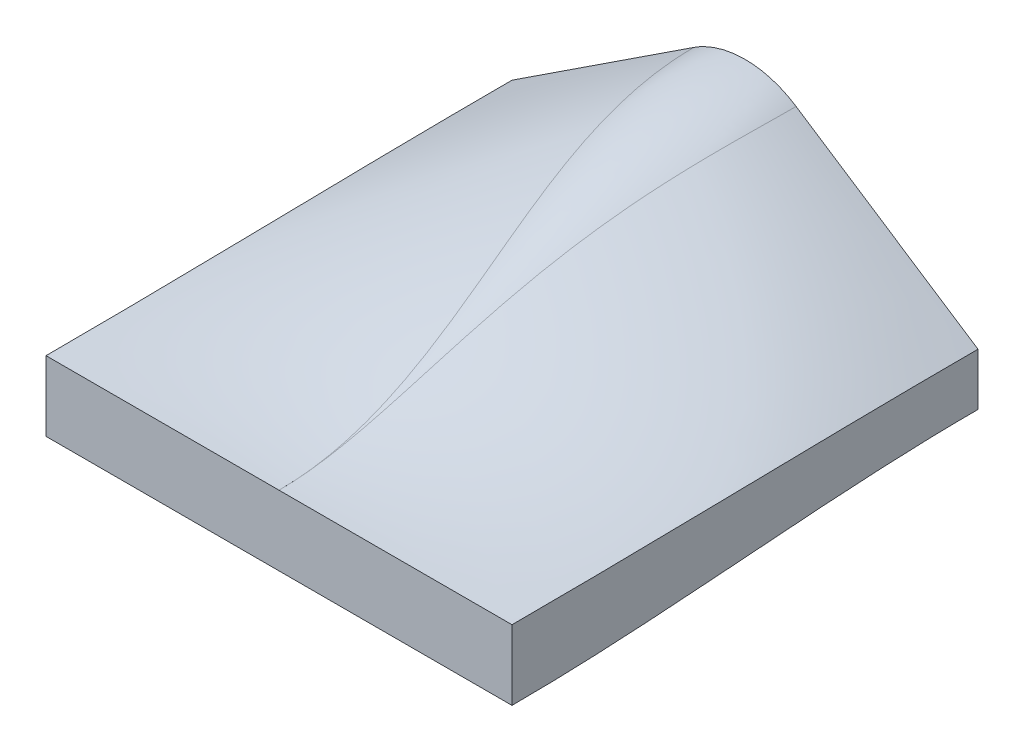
ISO-10303-21;
HEADER;
FILE_DESCRIPTION(('STEP AP214'),'2;1');
FILE_NAME('part.step','',(''),(''),'','','');
FILE_SCHEMA(('AUTOMOTIVE_DESIGN { 1 0 10303 214 1 1 1 1 }'));
ENDSEC;
DATA;
#1=APPLICATION_CONTEXT('core data for automotive mechanical design processes');
#2=APPLICATION_PROTOCOL_DEFINITION('international standard','automotive_design',2000,#1);
#3=PRODUCT_CONTEXT('',#1,'mechanical');
#4=PRODUCT('Part','Part','',(#3));
#5=PRODUCT_RELATED_PRODUCT_CATEGORY('part','',(#4));
#6=PRODUCT_DEFINITION_FORMATION('','',#4);
#7=PRODUCT_DEFINITION_CONTEXT('part definition',#1,'design');
#8=PRODUCT_DEFINITION('design','',#6,#7);
#9=PRODUCT_DEFINITION_SHAPE('','',#8);
#10=(LENGTH_UNIT() NAMED_UNIT(*) SI_UNIT(.MILLI.,.METRE.));
#11=(NAMED_UNIT(*) PLANE_ANGLE_UNIT() SI_UNIT($,.RADIAN.));
#12=(NAMED_UNIT(*) SI_UNIT($,.STERADIAN.) SOLID_ANGLE_UNIT());
#13=UNCERTAINTY_MEASURE_WITH_UNIT(LENGTH_MEASURE(1.E-05),#10,'distance_accuracy_value','');
#14=(GEOMETRIC_REPRESENTATION_CONTEXT(3) GLOBAL_UNCERTAINTY_ASSIGNED_CONTEXT((#13)) GLOBAL_UNIT_ASSIGNED_CONTEXT((#10,
#11,#12)) REPRESENTATION_CONTEXT('',''));
#15=CARTESIAN_POINT('',(0.,0.,0.));
#16=DIRECTION('',(0.,0.,1.));
#17=DIRECTION('',(1.,0.,0.));
#18=AXIS2_PLACEMENT_3D('',#15,#16,#17);
#19=CARTESIAN_POINT('',(0.,0.,-50.));
#20=DIRECTION('',(0.,0.,1.));
#21=DIRECTION('',(1.,0.,0.));
#22=AXIS2_PLACEMENT_3D('',#19,#20,#21);
#23=PLANE('',#22);
#24=DIRECTION('',(-0.836143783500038,-0.548510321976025,0.));
#25=VECTOR('',#24,1.);
#26=CARTESIAN_POINT('',(-25.,0.6,-50.));
#27=LINE('',#26,#25);
#28=CARTESIAN_POINT('',(-5.48510331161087,13.4017722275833,-50.));
#29=VERTEX_POINT('',#28);
#30=CARTESIAN_POINT('',(-25.,0.6,-50.));
#31=VERTEX_POINT('',#30);
#32=EDGE_CURVE('E180',#29,#31,#27,.T.);
#33=ORIENTED_EDGE('',*,*,#32,.F.);
#34=CARTESIAN_POINT('',(5.4851034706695,13.401772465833,-50.0000746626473));
#35=CARTESIAN_POINT('',(0.,17.0000004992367,-49.9997549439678));
#36=CARTESIAN_POINT('',(-5.48510347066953,13.4017724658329,-50.0000746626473));
#37=(BOUNDED_CURVE() B_SPLINE_CURVE(2,(#34,#35,#36),.UNSPECIFIED.,.F.,
.F.) B_SPLINE_CURVE_WITH_KNOTS((3,3),(0.,1.),
.UNSPECIFIED.) CURVE() GEOMETRIC_REPRESENTATION_ITEM() RATIONAL_B_SPLINE_CURVE((1.,
0.836143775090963,1.)) REPRESENTATION_ITEM(''));
#38=CARTESIAN_POINT('',(5.48510331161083,13.4017722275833,-50.));
#39=VERTEX_POINT('',#38);
#40=EDGE_CURVE('E108',#29,#39,#37,.F.);
#41=ORIENTED_EDGE('',*,*,#40,.T.);
#42=DIRECTION('',(-0.836143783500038,0.548510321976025,0.));
#43=VECTOR('',#42,1.);
#44=CARTESIAN_POINT('',(0.,17.,-50.));
#45=LINE('',#44,#43);
#46=CARTESIAN_POINT('',(25.,0.6,-50.));
#47=VERTEX_POINT('',#46);
#48=EDGE_CURVE('E320',#47,#39,#45,.T.);
#49=ORIENTED_EDGE('',*,*,#48,.F.);
#50=DIRECTION('',(0.,1.,0.));
#51=VECTOR('',#50,1.);
#52=CARTESIAN_POINT('',(25.,0.6,-50.));
#53=LINE('',#52,#51);
#54=CARTESIAN_POINT('',(25.,-5.,-50.));
#55=VERTEX_POINT('',#54);
#56=EDGE_CURVE('E250',#55,#47,#53,.T.);
#57=ORIENTED_EDGE('',*,*,#56,.F.);
#58=DIRECTION('',(1.,0.,0.));
#59=VECTOR('',#58,1.);
#60=CARTESIAN_POINT('',(-25.,-5.,-50.));
#61=LINE('',#60,#59);
#62=CARTESIAN_POINT('',(-25.,-5.,-50.));
#63=VERTEX_POINT('',#62);
#64=EDGE_CURVE('E184',#63,#55,#61,.T.);
#65=ORIENTED_EDGE('',*,*,#64,.F.);
#66=DIRECTION('',(0.,-1.,0.));
#67=VECTOR('',#66,1.);
#68=CARTESIAN_POINT('',(-25.,0.6,-50.));
#69=LINE('',#68,#67);
#70=EDGE_CURVE('E182',#31,#63,#69,.T.);
#71=ORIENTED_EDGE('',*,*,#70,.F.);
#72=EDGE_LOOP('',(#33,#41,#49,#57,#65,#71));
#73=FACE_BOUND('',#72,.T.);
#74=ADVANCED_FACE('F94',(#73),#23,.F.);
#75=CARTESIAN_POINT('',(0.,0.,0.));
#76=DIRECTION('',(0.,0.,1.));
#77=DIRECTION('',(1.,0.,0.));
#78=AXIS2_PLACEMENT_3D('',#75,#76,#77);
#79=PLANE('',#78);
#80=DIRECTION('',(0.,-1.,0.));
#81=VECTOR('',#80,1.);
#82=CARTESIAN_POINT('',(-25.,0.,0.));
#83=LINE('',#82,#81);
#84=CARTESIAN_POINT('',(-25.,0.,0.));
#85=VERTEX_POINT('',#84);
#86=CARTESIAN_POINT('',(-25.,-7.5,0.));
#87=VERTEX_POINT('',#86);
#88=EDGE_CURVE('E156',#85,#87,#83,.T.);
#89=ORIENTED_EDGE('',*,*,#88,.T.);
#90=DIRECTION('',(1.,0.,0.));
#91=VECTOR('',#90,1.);
#92=CARTESIAN_POINT('',(-25.,-7.5,0.));
#93=LINE('',#92,#91);
#94=CARTESIAN_POINT('',(25.,-7.5,0.));
#95=VERTEX_POINT('',#94);
#96=EDGE_CURVE('E175',#87,#95,#93,.T.);
#97=ORIENTED_EDGE('',*,*,#96,.T.);
#98=DIRECTION('',(0.,1.,0.));
#99=VECTOR('',#98,1.);
#100=CARTESIAN_POINT('',(25.,0.,0.));
#101=LINE('',#100,#99);
#102=CARTESIAN_POINT('',(25.,0.,0.));
#103=VERTEX_POINT('',#102);
#104=EDGE_CURVE('E302',#95,#103,#101,.T.);
#105=ORIENTED_EDGE('',*,*,#104,.T.);
#106=DIRECTION('',(-1.,0.,0.));
#107=VECTOR('',#106,1.);
#108=CARTESIAN_POINT('',(0.,0.,0.));
#109=LINE('',#108,#107);
#110=CARTESIAN_POINT('',(0.,0.,0.));
#111=VERTEX_POINT('',#110);
#112=EDGE_CURVE('E102',#103,#111,#109,.T.);
#113=ORIENTED_EDGE('',*,*,#112,.T.);
#114=DIRECTION('',(-1.,0.,0.));
#115=VECTOR('',#114,1.);
#116=CARTESIAN_POINT('',(-25.,0.,0.));
#117=LINE('',#116,#115);
#118=EDGE_CURVE('E151',#111,#85,#117,.T.);
#119=ORIENTED_EDGE('',*,*,#118,.T.);
#120=EDGE_LOOP('',(#89,#97,#105,#113,#119));
#121=FACE_BOUND('',#120,.T.);
#122=ADVANCED_FACE('F154',(#121),#79,.T.);
#123=CARTESIAN_POINT('',(25.,0.,0.));
#124=DIRECTION('',(1.,0.,0.));
#125=DIRECTION('',(0.,-1.,0.));
#126=AXIS2_PLACEMENT_3D('',#123,#124,#125);
#127=PLANE('',#126);
#128=ORIENTED_EDGE('',*,*,#104,.F.);
#129=CARTESIAN_POINT('',(25.,-7.5,0.));
#130=CARTESIAN_POINT('',(25.,-7.5,-16.6874869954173));
#131=CARTESIAN_POINT('',(25.,-5.,-33.3125130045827));
#132=CARTESIAN_POINT('',(25.,-5.,-50.));
#133=B_SPLINE_CURVE_WITH_KNOTS('',3,(#129,#130,#131,#132),.UNSPECIFIED.,.F.,.F.,(4,4),(0.,1.),.UNSPECIFIED.);
#134=EDGE_CURVE('E186',#95,#55,#133,.T.);
#135=ORIENTED_EDGE('',*,*,#134,.T.);
#136=ORIENTED_EDGE('',*,*,#56,.T.);
#137=CARTESIAN_POINT('',(25.,0.,0.));
#138=CARTESIAN_POINT('',(25.,0.,-16.6678666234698));
#139=CARTESIAN_POINT('',(25.,0.6,-33.3321333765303));
#140=CARTESIAN_POINT('',(25.,0.6,-50.));
#141=B_SPLINE_CURVE_WITH_KNOTS('',3,(#137,#138,#139,#140),.UNSPECIFIED.,.F.,.F.,(4,4),(0.,1.),.UNSPECIFIED.);
#142=EDGE_CURVE('E163',#47,#103,#141,.F.);
#143=ORIENTED_EDGE('',*,*,#142,.T.);
#144=EDGE_LOOP('',(#128,#135,#136,#143));
#145=FACE_BOUND('',#144,.T.);
#146=ADVANCED_FACE('F256',(#145),#127,.T.);
#147=CARTESIAN_POINT('',(25.,-7.5,0.));
#148=CARTESIAN_POINT('',(25.,-7.5,-16.6874869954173));
#149=CARTESIAN_POINT('',(25.,-5.,-33.3125130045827));
#150=CARTESIAN_POINT('',(25.,-5.,-50.));
#151=CARTESIAN_POINT('',(8.33333333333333,-7.5,0.));
#152=CARTESIAN_POINT('',(8.33333333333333,-7.5,-16.6874869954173));
#153=CARTESIAN_POINT('',(8.33333333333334,-5.,-33.3125130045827));
#154=CARTESIAN_POINT('',(8.33333333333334,-5.,-50.));
#155=CARTESIAN_POINT('',(-8.33333333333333,-7.5,0.));
#156=CARTESIAN_POINT('',(-8.33333333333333,-7.5,-16.6874869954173));
#157=CARTESIAN_POINT('',(-8.33333333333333,-5.,-33.3125130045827));
#158=CARTESIAN_POINT('',(-8.33333333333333,-5.,-50.));
#159=CARTESIAN_POINT('',(-25.,-7.5,0.));
#160=CARTESIAN_POINT('',(-25.,-7.5,-16.6874869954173));
#161=CARTESIAN_POINT('',(-25.,-5.,-33.3125130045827));
#162=CARTESIAN_POINT('',(-25.,-5.,-50.));
#163=B_SPLINE_SURFACE_WITH_KNOTS('',3,3,((#147,#148,#149,#150),(#151,#152,#153,#154),(#155,#156,
#157,#158),(#159,#160,#161,#162)),.UNSPECIFIED.,.F.,.F.,.F.,(4,4),(4,4),(0.,1.),(0.,1.),.UNSPECIFIED.);
#164=CARTESIAN_POINT('',(-25.,-7.5,0.));
#165=CARTESIAN_POINT('',(-25.,-7.5,-16.6874869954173));
#166=CARTESIAN_POINT('',(-25.,-5.,-33.3125130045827));
#167=CARTESIAN_POINT('',(-25.,-5.,-50.));
#168=B_SPLINE_CURVE_WITH_KNOTS('',3,(#164,#165,#166,#167),.UNSPECIFIED.,.F.,.F.,(4,4),(0.,1.),.UNSPECIFIED.);
#169=EDGE_CURVE('E174',#87,#63,#168,.T.);
#170=ORIENTED_EDGE('',*,*,#96,.F.);
#171=ORIENTED_EDGE('',*,*,#169,.T.);
#172=ORIENTED_EDGE('',*,*,#64,.T.);
#173=ORIENTED_EDGE('',*,*,#134,.F.);
#174=EDGE_LOOP('',(#170,#171,#172,#173));
#175=FACE_BOUND('',#174,.T.);
#176=ADVANCED_FACE('F221',(#175),#163,.T.);
#177=CARTESIAN_POINT('',(0.,0.,0.));
#178=CARTESIAN_POINT('',(0.,0.,-17.6036612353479));
#179=CARTESIAN_POINT('',(0.,17.,-32.3963387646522));
#180=CARTESIAN_POINT('',(0.,17.,-50.));
#181=CARTESIAN_POINT('',(8.33333333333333,0.,0.));
#182=CARTESIAN_POINT('',(8.33333333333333,0.,-17.2917296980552));
#183=CARTESIAN_POINT('',(8.33333333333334,11.5333333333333,-32.7082703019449));
#184=CARTESIAN_POINT('',(8.33333333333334,11.5333333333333,-50.));
#185=CARTESIAN_POINT('',(16.6666666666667,0.,0.));
#186=CARTESIAN_POINT('',(16.6666666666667,0.,-16.9797981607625));
#187=CARTESIAN_POINT('',(16.6666666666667,6.06666666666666,-33.0202018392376));
#188=CARTESIAN_POINT('',(16.6666666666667,6.06666666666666,-50.));
#189=CARTESIAN_POINT('',(25.,0.,0.));
#190=CARTESIAN_POINT('',(25.,0.,-16.6678666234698));
#191=CARTESIAN_POINT('',(25.,0.599999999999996,-33.3321333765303));
#192=CARTESIAN_POINT('',(25.,0.599999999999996,-50.));
#193=B_SPLINE_SURFACE_WITH_KNOTS('',3,3,((#177,#178,#179,#180),(#181,#182,#183,#184),(#185,#186,
#187,#188),(#189,#190,#191,#192)),.UNSPECIFIED.,.F.,.F.,.F.,(4,4),(4,4),(0.,1.),(0.,1.),.UNSPECIFIED.);
#194=CARTESIAN_POINT('',(5.48510331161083,13.4017722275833,-50.));
#195=CARTESIAN_POINT('',(5.48508552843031,13.4017823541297,-49.7032870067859));
#196=CARTESIAN_POINT('',(5.48210808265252,13.3998393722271,-49.4065811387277));
#197=CARTESIAN_POINT('',(5.47051180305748,13.391799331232,-48.8048983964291));
#198=CARTESIAN_POINT('',(5.46173506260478,13.3855857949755,-48.4999260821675));
#199=CARTESIAN_POINT('',(5.43854516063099,13.3685009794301,-47.8817567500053));
#200=CARTESIAN_POINT('',(5.42398082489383,13.357503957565,-47.5685689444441));
#201=CARTESIAN_POINT('',(5.38920624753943,13.3303439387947,-46.9340112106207));
#202=CARTESIAN_POINT('',(5.36885072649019,13.3140462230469,-46.6126550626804));
#203=CARTESIAN_POINT('',(5.32248882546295,13.2757629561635,-45.9617999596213));
#204=CARTESIAN_POINT('',(5.29634279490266,13.2536336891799,-45.6323193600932));
#205=CARTESIAN_POINT('',(5.25317329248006,13.2160325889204,-45.1353948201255));
#206=CARTESIAN_POINT('',(5.23795467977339,13.2026093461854,-44.9676344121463));
#207=CARTESIAN_POINT('',(5.20639055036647,13.1743953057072,-44.6333237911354));
#208=CARTESIAN_POINT('',(5.1900520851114,13.1596128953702,-44.4667722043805));
#209=CARTESIAN_POINT('',(5.13819967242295,13.1120132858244,-43.956120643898));
#210=CARTESIAN_POINT('',(5.10084717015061,13.0768002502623,-43.6124262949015));
#211=CARTESIAN_POINT('',(5.02020583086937,12.9982490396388,-42.9109865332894));
#212=CARTESIAN_POINT('',(4.97672689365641,12.954619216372,-42.5532958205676));
#213=CARTESIAN_POINT('',(4.88381604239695,12.8582374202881,-41.823963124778));
#214=CARTESIAN_POINT('',(4.83420825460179,12.8051731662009,-41.4523848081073));
#215=CARTESIAN_POINT('',(4.72902691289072,12.6889366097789,-40.6953764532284));
#216=CARTESIAN_POINT('',(4.67329032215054,12.625433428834,-40.3100199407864));
#217=CARTESIAN_POINT('',(4.55583741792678,12.487359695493,-39.5255440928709));
#218=CARTESIAN_POINT('',(4.49396960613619,12.4124420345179,-39.1265085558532));
#219=CARTESIAN_POINT('',(4.37010240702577,12.2579191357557,-38.3513817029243));
#220=CARTESIAN_POINT('',(4.30827626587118,12.1787585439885,-37.9751737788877));
#221=CARTESIAN_POINT('',(4.17755510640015,12.0064623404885,-37.1972864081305));
#222=CARTESIAN_POINT('',(4.108474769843,11.912726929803,-36.7957707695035));
#223=CARTESIAN_POINT('',(3.98246367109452,11.7365099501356,-36.0771019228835));
#224=CARTESIAN_POINT('',(3.92593557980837,11.6556441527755,-35.7594796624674));
#225=CARTESIAN_POINT('',(3.78793462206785,11.4538732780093,-34.9943567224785));
#226=CARTESIAN_POINT('',(3.70584744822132,11.3302817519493,-34.5476725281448));
#227=CARTESIAN_POINT('',(3.54320975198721,11.0766671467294,-33.671657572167));
#228=CARTESIAN_POINT('',(3.46269295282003,10.9469719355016,-33.2422254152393));
#229=CARTESIAN_POINT('',(3.33673946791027,10.7376964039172,-32.5752347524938));
#230=CARTESIAN_POINT('',(3.29150472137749,10.6612624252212,-32.3366454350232));
#231=CARTESIAN_POINT('',(3.20767193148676,10.5170924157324,-31.8954589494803));
#232=CARTESIAN_POINT('',(3.16907792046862,10.4497338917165,-31.6927376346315));
#233=CARTESIAN_POINT('',(3.05321942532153,10.2443164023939,-31.0843535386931));
#234=CARTESIAN_POINT('',(2.97610504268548,10.1032921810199,-30.6796617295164));
#235=CARTESIAN_POINT('',(2.80217821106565,9.77748590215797,-29.7696581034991));
#236=CARTESIAN_POINT('',(2.70536648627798,9.59072914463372,-29.2650537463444));
#237=CARTESIAN_POINT('',(2.55235137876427,9.28521004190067,-28.4633795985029));
#238=CARTESIAN_POINT('',(2.4956137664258,9.16961453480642,-28.1651995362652));
#239=CARTESIAN_POINT('',(2.36441967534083,8.89486617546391,-27.4680336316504));
#240=CARTESIAN_POINT('',(2.29054524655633,8.73434672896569,-27.0694761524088));
#241=CARTESIAN_POINT('',(2.14433693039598,8.40718107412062,-26.2710897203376));
#242=CARTESIAN_POINT('',(2.07201833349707,8.24049853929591,-25.871272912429));
#243=CARTESIAN_POINT('',(1.92611790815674,7.89415087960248,-25.0520224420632));
#244=CARTESIAN_POINT('',(1.85266863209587,7.71426326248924,-24.6326592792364));
#245=CARTESIAN_POINT('',(1.71126837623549,7.35657008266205,-23.8079109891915));
#246=CARTESIAN_POINT('',(1.64321751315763,7.17887304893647,-23.4024958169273));
#247=CARTESIAN_POINT('',(1.51253277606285,6.82709166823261,-22.6054472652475));
#248=CARTESIAN_POINT('',(1.44979438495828,6.65308043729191,-22.2137987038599));
#249=CARTESIAN_POINT('',(1.3297670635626,6.30996308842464,-21.4441150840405));
#250=CARTESIAN_POINT('',(1.27236451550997,6.14089671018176,-21.0660800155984));
#251=CARTESIAN_POINT('',(1.16300278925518,5.80877819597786,-20.3234847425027));
#252=CARTESIAN_POINT('',(1.11092113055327,5.64573317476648,-19.9589394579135));
#253=CARTESIAN_POINT('',(1.03618166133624,5.40399204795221,-19.4168346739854));
#254=CARTESIAN_POINT('',(1.01217155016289,5.32505714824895,-19.2395676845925));
#255=CARTESIAN_POINT('',(0.963018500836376,5.16082208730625,-18.8699174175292));
#256=CARTESIAN_POINT('',(0.937949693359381,5.0755439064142,-18.6775145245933));
#257=CARTESIAN_POINT('',(0.864509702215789,4.82147360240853,-18.1023375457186));
#258=CARTESIAN_POINT('',(0.817559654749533,4.65332639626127,-17.7190951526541));
#259=CARTESIAN_POINT('',(0.727987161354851,4.32137264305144,-16.954481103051));
#260=CARTESIAN_POINT('',(0.6853287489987,4.15754034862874,-16.5731248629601));
#261=CARTESIAN_POINT('',(0.604334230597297,3.83530862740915,-15.8121319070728));
#262=CARTESIAN_POINT('',(0.565959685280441,3.67687158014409,-15.4325152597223));
#263=CARTESIAN_POINT('',(0.493536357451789,3.36647620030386,-14.6748585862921));
#264=CARTESIAN_POINT('',(0.459446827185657,3.21446770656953,-14.296843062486));
#265=CARTESIAN_POINT('',(0.395599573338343,2.91792599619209,-13.5422529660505));
#266=CARTESIAN_POINT('',(0.365799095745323,2.77332983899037,-13.1657068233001));
#267=CARTESIAN_POINT('',(0.311420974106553,2.49715794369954,-12.4262393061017));
#268=CARTESIAN_POINT('',(0.286672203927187,2.36528937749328,-12.0634401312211));
#269=CARTESIAN_POINT('',(0.240310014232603,2.10692910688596,-11.3295350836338));
#270=CARTESIAN_POINT('',(0.218749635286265,1.9805487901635,-10.9583865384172));
#271=CARTESIAN_POINT('',(0.178770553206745,1.73461722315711,-10.2075582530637));
#272=CARTESIAN_POINT('',(0.160403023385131,1.61519459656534,-9.82783351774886));
#273=CARTESIAN_POINT('',(0.126810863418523,1.38471978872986,-9.0596173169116));
#274=CARTESIAN_POINT('',(0.111636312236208,1.2738161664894,-8.671078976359));
#275=CARTESIAN_POINT('',(0.0844284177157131,1.06200443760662,-7.88497088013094));
#276=CARTESIAN_POINT('',(0.0724449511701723,0.961268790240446,-7.48735260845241));
#277=CARTESIAN_POINT('',(0.0568930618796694,0.819493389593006,-6.88628194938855));
#278=CARTESIAN_POINT('',(0.052093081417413,0.773559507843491,-6.68400722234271));
#279=CARTESIAN_POINT('',(0.0438249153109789,0.690403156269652,-6.30250111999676));
#280=CARTESIAN_POINT('',(0.0402664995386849,0.652791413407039,-6.12335648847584));
#281=CARTESIAN_POINT('',(0.0300885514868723,0.540455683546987,-5.56634808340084));
#282=CARTESIAN_POINT('',(0.0244272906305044,0.470608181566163,-5.18747103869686));
#283=CARTESIAN_POINT('',(0.0148488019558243,0.340229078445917,-4.40196572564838));
#284=CARTESIAN_POINT('',(0.0110737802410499,0.280634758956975,-3.99517837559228));
#285=CARTESIAN_POINT('',(0.00750472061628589,0.215909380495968,-3.48134824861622));
#286=CARTESIAN_POINT('',(0.00683194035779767,0.203109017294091,-3.37524818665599));
#287=CARTESIAN_POINT('',(0.00496913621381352,0.164932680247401,-3.04403586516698));
#288=CARTESIAN_POINT('',(0.0040434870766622,0.141524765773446,-2.8186921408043));
#289=CARTESIAN_POINT('',(0.00203145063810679,0.0854105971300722,-2.21002404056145));
#290=CARTESIAN_POINT('',(0.00128397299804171,0.0576211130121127,-1.82623482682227));
#291=CARTESIAN_POINT('',(0.000250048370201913,0.0126917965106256,-0.961802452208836));
#292=CARTESIAN_POINT('',(0.000125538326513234,-4.98995706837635E-05,-0.480928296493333));
#293=CARTESIAN_POINT('',(0.,0.,0.));
#294=B_SPLINE_CURVE_WITH_KNOTS('',3,(#194,#195,#196,#197,#198,#199,#200,#201,#202,#203,#204,
#205,#206,#207,#208,#209,#210,#211,#212,#213,#214,#215,#216,#217,#218,#219,#220,#221,#222,#223,
#224,#225,#226,#227,#228,#229,#230,#231,#232,#233,#234,#235,#236,#237,#238,#239,#240,#241,#242,
#243,#244,#245,#246,#247,#248,#249,#250,#251,#252,#253,#254,#255,#256,#257,#258,#259,#260,#261,
#262,#263,#264,#265,#266,#267,#268,#269,#270,#271,#272,#273,#274,#275,#276,#277,#278,#279,#280,
#281,#282,#283,#284,#285,#286,#287,#288,#289,#290,#291,#292,#293),.UNSPECIFIED.,.F.,.F.,(4,2,2,
2,2,2,2,2,2,2,2,2,2,2,2,2,2,2,2,2,2,2,2,2,2,2,2,2,2,2,2,2,2,2,2,2,2,2,2,2,2,2,2,2,2,2,2,2,2,4),
(0.,0.89010778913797,1.80550971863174,2.74658478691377,3.71373986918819,4.70741614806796,
5.21435664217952,5.7183555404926,6.76077953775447,7.84955175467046,8.98528333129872,
10.1687047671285,11.4006657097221,12.5687311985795,13.8227900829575,14.820526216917,
16.2324237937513,17.5995848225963,18.3633229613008,19.0145456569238,20.3207992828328,
21.9607698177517,22.9351411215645,24.2430079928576,25.5604760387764,26.9470161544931,
28.2905428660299,29.5899287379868,30.8441495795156,32.0523162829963,32.6388951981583,
33.2747210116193,34.5380905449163,35.789790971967,37.0291609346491,38.2556729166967,
39.4689567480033,40.6293136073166,41.8072079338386,43.0025207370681,44.2153751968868,
45.4462012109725,46.0686126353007,46.6178479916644,47.7735181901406,49.0065917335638,
49.3272033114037,50.0068195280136,51.1608829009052,52.6034094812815),.UNSPECIFIED.);
#295=EDGE_CURVE('E12',#39,#111,#294,.T.);
#296=ORIENTED_EDGE('',*,*,#48,.T.);
#297=ORIENTED_EDGE('',*,*,#295,.T.);
#298=ORIENTED_EDGE('',*,*,#112,.F.);
#299=ORIENTED_EDGE('',*,*,#142,.F.);
#300=EDGE_LOOP('',(#296,#297,#298,#299));
#301=FACE_BOUND('',#300,.T.);
#302=ADVANCED_FACE('F209',(#301),#193,.T.);
#303=CARTESIAN_POINT('',(-25.,-7.5,0.));
#304=DIRECTION('',(-1.,0.,0.));
#305=DIRECTION('',(0.,1.,0.));
#306=AXIS2_PLACEMENT_3D('',#303,#304,#305);
#307=PLANE('',#306);
#308=ORIENTED_EDGE('',*,*,#88,.F.);
#309=CARTESIAN_POINT('',(-25.,0.,0.));
#310=CARTESIAN_POINT('',(-25.,0.,-16.6678666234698));
#311=CARTESIAN_POINT('',(-25.,0.6,-33.3321333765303));
#312=CARTESIAN_POINT('',(-25.,0.6,-50.));
#313=B_SPLINE_CURVE_WITH_KNOTS('',3,(#309,#310,#311,#312),.UNSPECIFIED.,.F.,.F.,(4,4),(0.,1.),.UNSPECIFIED.);
#314=EDGE_CURVE('E171',#85,#31,#313,.T.);
#315=ORIENTED_EDGE('',*,*,#314,.T.);
#316=ORIENTED_EDGE('',*,*,#70,.T.);
#317=ORIENTED_EDGE('',*,*,#169,.F.);
#318=EDGE_LOOP('',(#308,#315,#316,#317));
#319=FACE_BOUND('',#318,.T.);
#320=ADVANCED_FACE('F169',(#319),#307,.T.);
#321=CARTESIAN_POINT('',(-25.,0.,0.));
#322=CARTESIAN_POINT('',(-25.,0.,-16.6678666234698));
#323=CARTESIAN_POINT('',(-25.,0.6,-33.3321333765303));
#324=CARTESIAN_POINT('',(-25.,0.6,-50.));
#325=CARTESIAN_POINT('',(-16.6666666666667,0.,0.));
#326=CARTESIAN_POINT('',(-16.6666666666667,0.,-16.9797981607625));
#327=CARTESIAN_POINT('',(-16.6666666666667,6.06666666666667,-33.0202018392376));
#328=CARTESIAN_POINT('',(-16.6666666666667,6.06666666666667,-50.));
#329=CARTESIAN_POINT('',(-8.33333333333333,0.,0.));
#330=CARTESIAN_POINT('',(-8.33333333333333,0.,-17.2917296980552));
#331=CARTESIAN_POINT('',(-8.33333333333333,11.5333333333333,-32.7082703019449));
#332=CARTESIAN_POINT('',(-8.33333333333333,11.5333333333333,-50.));
#333=CARTESIAN_POINT('',(0.,0.,0.));
#334=CARTESIAN_POINT('',(0.,0.,-17.6036612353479));
#335=CARTESIAN_POINT('',(0.,17.,-32.3963387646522));
#336=CARTESIAN_POINT('',(0.,17.,-50.));
#337=B_SPLINE_SURFACE_WITH_KNOTS('',3,3,((#321,#322,#323,#324),(#325,#326,#327,#328),(#329,#330,
#331,#332),(#333,#334,#335,#336)),.UNSPECIFIED.,.F.,.F.,.F.,(4,4),(4,4),(0.,1.),(0.,1.),.UNSPECIFIED.);
#338=CARTESIAN_POINT('',(0.,0.,0.));
#339=CARTESIAN_POINT('',(-0.000218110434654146,-6.89747551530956E-05,-0.523665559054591));
#340=CARTESIAN_POINT('',(-0.000314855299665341,0.0150493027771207,-1.04727157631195));
#341=CARTESIAN_POINT('',(-0.00152896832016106,0.0675887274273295,-1.9769568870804));
#342=CARTESIAN_POINT('',(-0.00241536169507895,0.0993236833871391,-2.38336181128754));
#343=CARTESIAN_POINT('',(-0.00461242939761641,0.155285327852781,-2.94910256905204));
#344=CARTESIAN_POINT('',(-0.00534200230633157,0.17243936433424,-3.10916585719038));
#345=CARTESIAN_POINT('',(-0.00752661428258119,0.217540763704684,-3.50045142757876));
#346=CARTESIAN_POINT('',(-0.00916014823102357,0.246886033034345,-3.73151269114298));
#347=CARTESIAN_POINT('',(-0.014821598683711,0.339450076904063,-4.40015740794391));
#348=CARTESIAN_POINT('',(-0.0196822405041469,0.409418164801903,-4.83681424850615));
#349=CARTESIAN_POINT('',(-0.0318614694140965,0.561195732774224,-5.67646323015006));
#350=CARTESIAN_POINT('',(-0.0389842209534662,0.641833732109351,-6.07967261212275));
#351=CARTESIAN_POINT('',(-0.057332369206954,0.826125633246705,-6.92517195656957));
#352=CARTESIAN_POINT('',(-0.0689099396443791,0.931306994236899,-7.36712131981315));
#353=CARTESIAN_POINT('',(-0.0960156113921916,1.15504975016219,-8.23985213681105));
#354=CARTESIAN_POINT('',(-0.111476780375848,1.27336719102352,-8.67069860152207));
#355=CARTESIAN_POINT('',(-0.146323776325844,1.52110694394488,-9.52157876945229));
#356=CARTESIAN_POINT('',(-0.165643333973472,1.65032291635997,-9.94167550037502));
#357=CARTESIAN_POINT('',(-0.208215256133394,1.91772193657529,-10.7713826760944));
#358=CARTESIAN_POINT('',(-0.231399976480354,2.0557290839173,-11.1810535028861));
#359=CARTESIAN_POINT('',(-0.28169698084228,2.3387114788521,-11.9902170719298));
#360=CARTESIAN_POINT('',(-0.308739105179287,2.48353652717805,-12.3897668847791));
#361=CARTESIAN_POINT('',(-0.368593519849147,2.7875229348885,-13.2037099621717));
#362=CARTESIAN_POINT('',(-0.401611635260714,2.94703650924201,-13.6179561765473));
#363=CARTESIAN_POINT('',(-0.472782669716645,3.2748360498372,-14.4482888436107));
#364=CARTESIAN_POINT('',(-0.510992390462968,3.44320424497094,-14.864337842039));
#365=CARTESIAN_POINT('',(-0.592540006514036,3.78741408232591,-15.6984474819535));
#366=CARTESIAN_POINT('',(-0.635931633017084,3.96331924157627,-16.1164765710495));
#367=CARTESIAN_POINT('',(-0.727861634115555,4.3212271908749,-16.9547265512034));
#368=CARTESIAN_POINT('',(-0.776450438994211,4.50327526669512,-17.3749225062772));
#369=CARTESIAN_POINT('',(-0.878725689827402,4.87204302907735,-18.217698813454));
#370=CARTESIAN_POINT('',(-0.932458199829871,5.05879121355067,-18.6402610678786));
#371=CARTESIAN_POINT('',(-1.04111397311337,5.42168735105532,-19.4570677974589));
#372=CARTESIAN_POINT('',(-1.09574007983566,5.59774737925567,-19.8513910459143));
#373=CARTESIAN_POINT('',(-1.21130921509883,5.95759508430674,-20.6563471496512));
#374=CARTESIAN_POINT('',(-1.27242285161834,6.14138958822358,-21.0669523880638));
#375=CARTESIAN_POINT('',(-1.4009319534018,6.51542489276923,-21.9046037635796));
#376=CARTESIAN_POINT('',(-1.46848145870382,6.70562613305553,-22.3316439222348));
#377=CARTESIAN_POINT('',(-1.6098973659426,7.09089656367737,-23.202335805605));
#378=CARTESIAN_POINT('',(-1.68390614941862,7.28587704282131,-23.6460037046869));
#379=CARTESIAN_POINT('',(-1.83821886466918,7.67885829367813,-24.5501694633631));
#380=CARTESIAN_POINT('',(-1.91865301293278,7.87672047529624,-25.0107055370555));
#381=CARTESIAN_POINT('',(-2.07266155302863,8.24177242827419,-25.8743620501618));
#382=CARTESIAN_POINT('',(-2.14579332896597,8.40964237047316,-26.2772737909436));
#383=CARTESIAN_POINT('',(-2.3025797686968,8.7589518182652,-27.1304181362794));
#384=CARTESIAN_POINT('',(-2.38648984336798,8.93978173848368,-27.5808542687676));
#385=CARTESIAN_POINT('',(-2.51716818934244,9.21203328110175,-28.2753845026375));
#386=CARTESIAN_POINT('',(-2.56316853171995,9.30613112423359,-28.5185756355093));
#387=CARTESIAN_POINT('',(-2.65145137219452,9.48369542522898,-28.9839272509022));
#388=CARTESIAN_POINT('',(-2.69369764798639,9.56735896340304,-29.2060194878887));
#389=CARTESIAN_POINT('',(-2.82038454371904,9.81474360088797,-29.8716649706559));
#390=CARTESIAN_POINT('',(-2.90509280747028,9.97551827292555,-30.3162697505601));
#391=CARTESIAN_POINT('',(-3.07531705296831,10.286937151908,-31.2062268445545));
#392=CARTESIAN_POINT('',(-3.16082668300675,10.4376289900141,-31.6515636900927));
#393=CARTESIAN_POINT('',(-3.34283077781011,10.7482883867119,-32.6037777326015));
#394=CARTESIAN_POINT('',(-3.43930269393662,10.9069005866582,-33.1111026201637));
#395=CARTESIAN_POINT('',(-3.62318805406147,11.2002833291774,-34.0936184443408));
#396=CARTESIAN_POINT('',(-3.71075597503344,11.3359476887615,-34.5685132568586));
#397=CARTESIAN_POINT('',(-3.87723057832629,11.5852528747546,-35.4859293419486));
#398=CARTESIAN_POINT('',(-3.9562911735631,11.699783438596,-35.9281804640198));
#399=CARTESIAN_POINT('',(-4.10562482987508,11.9091312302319,-36.7800381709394));
#400=CARTESIAN_POINT('',(-4.1760925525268,12.0047933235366,-37.1894028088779));
#401=CARTESIAN_POINT('',(-4.30820264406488,12.1788028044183,-37.9751824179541));
#402=CARTESIAN_POINT('',(-4.37008115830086,12.2579321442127,-38.3513846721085));
#403=CARTESIAN_POINT('',(-4.50021071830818,12.4201819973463,-39.1654063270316));
#404=CARTESIAN_POINT('',(-4.56792624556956,12.5019614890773,-39.6035799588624));
#405=CARTESIAN_POINT('',(-4.69576143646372,12.6513509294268,-40.4634829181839));
#406=CARTESIAN_POINT('',(-4.75608308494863,12.71942126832,-40.8851022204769));
#407=CARTESIAN_POINT('',(-4.86908749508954,12.8427382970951,-41.7117494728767));
#408=CARTESIAN_POINT('',(-4.9219905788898,12.8984203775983,-42.1166822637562));
#409=CARTESIAN_POINT('',(-5.02014580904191,12.9983271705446,-42.9097959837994));
#410=CARTESIAN_POINT('',(-5.06563723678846,13.0429594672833,-43.2978959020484));
#411=CARTESIAN_POINT('',(-5.14895069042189,13.1221531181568,-44.0571785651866));
#412=CARTESIAN_POINT('',(-5.18703367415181,13.1570909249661,-44.4282933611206));
#413=CARTESIAN_POINT('',(-5.25666836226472,13.2193387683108,-45.1658522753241));
#414=CARTESIAN_POINT('',(-5.28831327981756,13.2467600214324,-45.5322781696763));
#415=CARTESIAN_POINT('',(-5.34441184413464,13.294092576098,-46.2553571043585));
#416=CARTESIAN_POINT('',(-5.36904849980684,13.3141997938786,-46.6119830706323));
#417=CARTESIAN_POINT('',(-5.41112437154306,13.3476255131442,-47.3153920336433));
#418=CARTESIAN_POINT('',(-5.42875456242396,13.361126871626,-47.6621548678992));
#419=CARTESIAN_POINT('',(-5.45681359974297,13.3820463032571,-48.3457696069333));
#420=CARTESIAN_POINT('',(-5.46744190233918,13.3896341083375,-48.6826080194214));
#421=CARTESIAN_POINT('',(-5.48147056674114,13.3994254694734,-49.3462986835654));
#422=CARTESIAN_POINT('',(-5.48508017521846,13.4017852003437,-49.673144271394));
#423=CARTESIAN_POINT('',(-5.48510331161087,13.4017722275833,-50.));
#424=B_SPLINE_CURVE_WITH_KNOTS('',3,(#338,#339,#340,#341,#342,#343,#344,#345,#346,#347,#348,
#349,#350,#351,#352,#353,#354,#355,#356,#357,#358,#359,#360,#361,#362,#363,#364,#365,#366,#367,
#368,#369,#370,#371,#372,#373,#374,#375,#376,#377,#378,#379,#380,#381,#382,#383,#384,#385,#386,
#387,#388,#389,#390,#391,#392,#393,#394,#395,#396,#397,#398,#399,#400,#401,#402,#403,#404,#405,
#406,#407,#408,#409,#410,#411,#412,#413,#414,#415,#416,#417,#418,#419,#420,#421,#422,#423),
.UNSPECIFIED.,.F.,.F.,(4,2,2,2,2,2,2,2,2,2,2,2,2,2,2,2,2,2,2,2,2,2,2,2,2,2,2,2,2,2,2,2,2,2,2,2,
2,2,2,2,2,2,4),(0.,1.57068494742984,2.79322657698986,3.27615558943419,3.97486658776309,
5.30120372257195,6.5347132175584,7.89770540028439,9.23865009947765,10.5582863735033,
11.8568741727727,13.1343004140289,14.4695669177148,15.8208377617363,17.1875879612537,
18.5690687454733,19.9643464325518,21.2701777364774,22.632146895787,24.0491410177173,
25.5198391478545,27.0427587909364,28.370431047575,29.8480983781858,30.6424495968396,
31.3656193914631,32.8064533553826,34.2399140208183,35.8604184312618,37.3650515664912,
38.7558050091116,40.0344610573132,41.2025169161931,42.5549165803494,43.8487236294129,
45.0850452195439,46.2648136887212,47.3887886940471,48.4951048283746,49.5691153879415,
50.6114257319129,51.6225883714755,52.6031131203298),.UNSPECIFIED.);
#425=EDGE_CURVE('E325',#111,#29,#424,.T.);
#426=ORIENTED_EDGE('',*,*,#118,.F.);
#427=ORIENTED_EDGE('',*,*,#425,.T.);
#428=ORIENTED_EDGE('',*,*,#32,.T.);
#429=ORIENTED_EDGE('',*,*,#314,.F.);
#430=EDGE_LOOP('',(#426,#427,#428,#429));
#431=FACE_BOUND('',#430,.T.);
#432=ADVANCED_FACE('F179',(#431),#337,.T.);
#433=CARTESIAN_POINT('',(0.,0.,0.));
#434=CARTESIAN_POINT('',(0.,0.,-0.0180506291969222));
#435=CARTESIAN_POINT('',(2.95277214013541E-13,1.78742409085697E-05,-0.0360983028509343));
#436=CARTESIAN_POINT('',(-5.66201207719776E-08,8.9297891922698E-05,-0.0721877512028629));
#437=CARTESIAN_POINT('',(-1.13224740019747E-07,0.000142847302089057,-0.0902295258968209));
#438=CARTESIAN_POINT('',(-4.52774447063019E-07,0.000356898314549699,-0.144346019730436));
#439=CARTESIAN_POINT('',(-9.0543678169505E-07,0.00057080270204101,-0.180411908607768));
#440=CARTESIAN_POINT('',(-3.61940582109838E-06,0.00142524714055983,-0.288574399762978));
#441=CARTESIAN_POINT('',(-7.23750960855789E-06,0.00227851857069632,-0.360635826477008));
#442=CARTESIAN_POINT('',(-2.89101669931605E-05,0.00568221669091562,-0.576680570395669));
#443=CARTESIAN_POINT('',(-5.77968250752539E-05,0.00907653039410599,-0.720524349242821));
#444=CARTESIAN_POINT('',(-0.00023047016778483,0.0225786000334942,-1.15150691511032));
#445=CARTESIAN_POINT('',(-0.00046055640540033,0.0360055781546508,-1.43809686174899));
#446=CARTESIAN_POINT('',(-0.00182838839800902,0.0891094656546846,-2.29574822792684));
#447=CARTESIAN_POINT('',(-0.00365002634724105,0.141611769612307,-2.86468892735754));
#448=CARTESIAN_POINT('',(-0.0143127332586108,0.346718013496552,-4.5637030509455));
#449=CARTESIAN_POINT('',(-0.0284776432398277,0.546967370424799,-5.68590921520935));
#450=CARTESIAN_POINT('',(-0.10784088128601,1.30712985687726,-9.02817809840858));
#451=CARTESIAN_POINT('',(-0.211501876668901,2.0269015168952,-11.223149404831));
#452=CARTESIAN_POINT('',(-0.56041815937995,3.71237096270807,-15.6050108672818));
#453=CARTESIAN_POINT('',(-0.805346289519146,4.67808378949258,-17.7929252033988));
#454=CARTESIAN_POINT('',(-1.43217881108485,6.660840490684,-22.2303408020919));
#455=CARTESIAN_POINT('',(-1.815042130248,7.67743047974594,-24.4823343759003));
#456=CARTESIAN_POINT('',(-2.66144696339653,9.55464642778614,-29.0803398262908));
#457=CARTESIAN_POINT('',(-3.12466967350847,10.4119728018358,-31.4301278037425));
#458=CARTESIAN_POINT('',(-3.99955107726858,11.7981392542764,-36.1169558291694));
#459=CARTESIAN_POINT('',(-4.40639008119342,12.3233491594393,-38.4486804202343));
#460=CARTESIAN_POINT('',(-4.87739863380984,12.8554353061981,-41.7328390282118));
#461=CARTESIAN_POINT('',(-5.01185389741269,12.9919257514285,-42.7912724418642));
#462=CARTESIAN_POINT('',(-5.23052715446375,13.1990662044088,-44.8160696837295));
#463=CARTESIAN_POINT('',(-5.31487661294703,13.2700184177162,-45.7819344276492));
#464=CARTESIAN_POINT('',(-5.43428893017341,13.3656326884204,-47.6313110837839));
#465=CARTESIAN_POINT('',(-5.46956204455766,13.390655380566,-48.5146866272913));
#466=CARTESIAN_POINT('',(-5.48244059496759,13.3998770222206,-49.4906772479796));
#467=CARTESIAN_POINT('',(-5.48349716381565,13.4006300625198,-49.598899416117));
#468=CARTESIAN_POINT('',(-5.48451875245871,13.4013571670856,-49.761008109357));
#469=CARTESIAN_POINT('',(-5.48476539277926,13.4015324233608,-49.815006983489));
#470=CARTESIAN_POINT('',(-5.48499419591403,13.4016949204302,-49.8959632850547));
#471=CARTESIAN_POINT('',(-5.48504693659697,13.4017323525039,-49.9229417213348));
#472=CARTESIAN_POINT('',(-5.48509070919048,13.4017634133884,-49.963400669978));
#473=CARTESIAN_POINT('',(-5.48509941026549,13.4017695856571,-49.9768855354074));
#474=CARTESIAN_POINT('',(-5.48510502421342,13.4017735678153,-50.0038526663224));
#475=CARTESIAN_POINT('',(-5.48510321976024,13.4017722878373,-50.0232079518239));
#476=CARTESIAN_POINT('',(-5.48510321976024,13.4017722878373,-50.3300686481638));
#477=CARTESIAN_POINT('',(-5.48510321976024,13.4017722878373,-50.6188787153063));
#478=CARTESIAN_POINT('',(-5.48510321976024,13.4017722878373,-51.4853089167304));
#479=CARTESIAN_POINT('',(-5.48510321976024,13.4017722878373,-52.062929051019));
#480=CARTESIAN_POINT('',(-5.48510321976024,13.4017722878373,-52.6405491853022));
#481=CARTESIAN_POINT('',(0.,0.,0.));
#482=CARTESIAN_POINT('',(0.,0.,-0.0180506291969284));
#483=CARTESIAN_POINT('',(0.,1.78742450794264E-05,-0.036098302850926));
#484=CARTESIAN_POINT('',(0.,8.92978877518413E-05,-0.0721877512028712));
#485=CARTESIAN_POINT('',(0.,0.000142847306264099,-0.0902295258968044));
#486=CARTESIAN_POINT('',(0.,0.000356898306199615,-0.144346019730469));
#487=CARTESIAN_POINT('',(0.,0.000570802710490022,-0.180411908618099));
#488=CARTESIAN_POINT('',(0.,0.00142524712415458,-0.288574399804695));
#489=CARTESIAN_POINT('',(-2.54203477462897E-13,0.00227851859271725,-0.360635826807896));
#490=CARTESIAN_POINT('',(5.06859112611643E-13,0.00568221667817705,-0.576680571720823));
#491=CARTESIAN_POINT('',(-3.37917533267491E-13,0.00907653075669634,-0.720524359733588));
#492=CARTESIAN_POINT('',(6.76849351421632E-13,0.0225786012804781,-1.15150695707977));
#493=CARTESIAN_POINT('',(4.87342757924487E-12,0.0360058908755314,-1.43809718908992));
#494=CARTESIAN_POINT('',(-9.77705784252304E-12,0.0891140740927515,-2.29574922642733));
#495=CARTESIAN_POINT('',(-2.0948687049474E-12,0.141622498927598,-2.86469872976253));
#496=CARTESIAN_POINT('',(4.213136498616E-12,0.346861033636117,-4.56372417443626));
#497=CARTESIAN_POINT('',(-3.91944023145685E-12,0.547344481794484,-5.68616580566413));
#498=CARTESIAN_POINT('',(7.85246450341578E-12,1.31126781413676,-9.0283051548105));
#499=CARTESIAN_POINT('',(3.61601329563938E-12,2.03913081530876,-11.2273732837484));
#500=CARTESIAN_POINT('',(-3.65759067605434E-12,3.77776041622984,-15.5852904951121));
#501=CARTESIAN_POINT('',(1.23142781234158E-13,4.79658047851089,-17.7591521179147));
#502=CARTESIAN_POINT('',(-1.35498036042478E-13,6.97010853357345,-22.0998275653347));
#503=CARTESIAN_POINT('',(0.,8.13820346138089,-24.2889280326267));
#504=CARTESIAN_POINT('',(0.,10.4569858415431,-28.6990692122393));
#505=CARTESIAN_POINT('',(1.0117219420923E-12,11.6182797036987,-30.9435368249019));
#506=CARTESIAN_POINT('',(-1.04330417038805E-12,13.7227867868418,-35.4764691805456));
#507=CARTESIAN_POINT('',(6.42767364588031E-12,14.6516996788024,-37.765964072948));
#508=CARTESIAN_POINT('',(-3.27906856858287E-12,15.7057842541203,-41.1022705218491));
#509=CARTESIAN_POINT('',(-2.96427484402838E-12,16.0014158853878,-42.2020198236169));
#510=CARTESIAN_POINT('',(2.98791500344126E-12,16.4754777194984,-44.3441263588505));
#511=CARTESIAN_POINT('',(7.4448593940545E-13,16.6520991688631,-45.3803638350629));
#512=CARTESIAN_POINT('',(-7.3862493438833E-13,16.8990318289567,-47.3906276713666));
#513=CARTESIAN_POINT('',(-1.4930096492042E-12,16.9690082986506,-48.3596809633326));
#514=CARTESIAN_POINT('',(1.89650372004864E-13,16.9946969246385,-49.4369472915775));
#515=CARTESIAN_POINT('',(-3.0981295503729E-13,16.9968020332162,-49.5565127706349));
#516=CARTESIAN_POINT('',(1.58816009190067E-13,16.9988366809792,-49.7356996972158));
#517=CARTESIAN_POINT('',(0.,16.9993276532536,-49.7954017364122));
#518=CARTESIAN_POINT('',(0.,16.9997830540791,-49.8849272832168));
#519=CARTESIAN_POINT('',(0.,16.9998880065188,-49.9147645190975));
#520=CARTESIAN_POINT('',(0.,16.9999751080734,-49.9595151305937));
#521=CARTESIAN_POINT('',(0.,16.9999924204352,-49.9744311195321));
#522=CARTESIAN_POINT('',(0.,17.0000035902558,-50.004261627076));
#523=CARTESIAN_POINT('',(0.,17.,-50.023207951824));
#524=CARTESIAN_POINT('',(-3.74886840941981E-13,16.9999999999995,-50.3300686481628));
#525=CARTESIAN_POINT('',(0.,17.,-50.6188787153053));
#526=CARTESIAN_POINT('',(0.,17.,-51.4853089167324));
#527=CARTESIAN_POINT('',(0.,17.000000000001,-52.0629290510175));
#528=CARTESIAN_POINT('',(0.,17.,-52.6405491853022));
#529=CARTESIAN_POINT('',(0.,0.,0.));
#530=CARTESIAN_POINT('',(0.,0.,-0.0180506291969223));
#531=CARTESIAN_POINT('',(-2.70544382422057E-13,1.78742409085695E-05,-0.0360983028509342));
#532=CARTESIAN_POINT('',(5.66200965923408E-08,8.92978919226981E-05,-0.072187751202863));
#533=CARTESIAN_POINT('',(1.13224753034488E-07,0.000142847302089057,-0.0902295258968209));
#534=CARTESIAN_POINT('',(4.52774413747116E-07,0.000356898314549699,-0.144346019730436));
#535=CARTESIAN_POINT('',(9.0543686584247E-07,0.000570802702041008,-0.180411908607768));
#536=CARTESIAN_POINT('',(3.61940564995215E-06,0.00142524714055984,-0.288574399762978));
#537=CARTESIAN_POINT('',(7.23750910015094E-06,0.00227851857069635,-0.360635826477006));
#538=CARTESIAN_POINT('',(2.89101680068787E-05,0.00568221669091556,-0.576680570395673));
#539=CARTESIAN_POINT('',(5.77968243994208E-05,0.0090765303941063,-0.720524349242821));
#540=CARTESIAN_POINT('',(0.000230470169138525,0.0225786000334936,-1.15150691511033));
#541=CARTESIAN_POINT('',(0.00046055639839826,0.0360055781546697,-1.43809686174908));
#542=CARTESIAN_POINT('',(0.00182838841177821,0.0891094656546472,-2.29574822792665));
#543=CARTESIAN_POINT('',(0.003650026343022,0.141611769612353,-2.86468892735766));
#544=CARTESIAN_POINT('',(0.0143127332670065,0.34671801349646,-4.56370305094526));
#545=CARTESIAN_POINT('',(0.0284776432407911,0.546967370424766,-5.68590921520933));
#546=CARTESIAN_POINT('',(0.107840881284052,1.30712985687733,-9.02817809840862));
#547=CARTESIAN_POINT('',(0.211501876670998,2.02690151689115,-11.2231494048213));
#548=CARTESIAN_POINT('',(0.560418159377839,3.71237096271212,-15.6050108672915));
#549=CARTESIAN_POINT('',(0.805346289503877,4.67808378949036,-17.792925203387));
#550=CARTESIAN_POINT('',(1.43217881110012,6.66084049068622,-22.2303408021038));
#551=CARTESIAN_POINT('',(1.81504213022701,7.67743047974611,-24.4823343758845));
#552=CARTESIAN_POINT('',(2.66144696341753,9.55464642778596,-29.0803398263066));
#553=CARTESIAN_POINT('',(3.12466967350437,10.4119728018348,-31.4301278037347));
#554=CARTESIAN_POINT('',(3.99955107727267,11.7981392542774,-36.1169558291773));
#555=CARTESIAN_POINT('',(4.40639008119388,12.3233491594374,-38.4486804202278));
#556=CARTESIAN_POINT('',(4.87739863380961,12.855435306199,-41.7328390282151));
#557=CARTESIAN_POINT('',(5.01185389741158,12.9919257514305,-42.7912724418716));
#558=CARTESIAN_POINT('',(5.23052715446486,13.1990662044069,-44.8160696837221));
#559=CARTESIAN_POINT('',(5.31487661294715,13.2700184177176,-45.7819344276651));
#560=CARTESIAN_POINT('',(5.43428893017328,13.365632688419,-47.6313110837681));
#561=CARTESIAN_POINT('',(5.4695620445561,13.3906553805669,-48.5146866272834));
#562=CARTESIAN_POINT('',(5.48244059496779,13.3998770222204,-49.4906772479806));
#563=CARTESIAN_POINT('',(5.48349716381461,13.4006300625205,-49.5988994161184));
#564=CARTESIAN_POINT('',(5.48451875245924,13.4013571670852,-49.7610081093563));
#565=CARTESIAN_POINT('',(5.48476539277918,13.4015324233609,-49.8150069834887));
#566=CARTESIAN_POINT('',(5.48499419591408,13.4016949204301,-49.8959632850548));
#567=CARTESIAN_POINT('',(5.48504693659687,13.401732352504,-49.922941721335));
#568=CARTESIAN_POINT('',(5.48509070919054,13.4017634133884,-49.9634006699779));
#569=CARTESIAN_POINT('',(5.48509941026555,13.4017695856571,-49.9768855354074));
#570=CARTESIAN_POINT('',(5.48510502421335,13.4017735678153,-50.0038526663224));
#571=CARTESIAN_POINT('',(5.48510321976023,13.4017722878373,-50.0232079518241));
#572=CARTESIAN_POINT('',(5.48510321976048,13.4017722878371,-50.3300686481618));
#573=CARTESIAN_POINT('',(5.48510321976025,13.4017722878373,-50.6188787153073));
#574=CARTESIAN_POINT('',(5.48510321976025,13.4017722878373,-51.4853089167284));
#575=CARTESIAN_POINT('',(5.48510321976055,13.4017722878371,-52.0629290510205));
#576=CARTESIAN_POINT('',(5.48510321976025,13.4017722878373,-52.6405491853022));
#577=(BOUNDED_SURFACE() B_SPLINE_SURFACE(2,3,((#433,#434,#435,#436,#437,#438,#439,#440,#441,
#442,#443,#444,#445,#446,#447,#448,#449,#450,#451,#452,#453,#454,#455,#456,#457,#458,#459,#460,
#461,#462,#463,#464,#465,#466,#467,#468,#469,#470,#471,#472,#473,#474,#475,#476,#477,#478,#479,
#480),(#481,#482,#483,#484,#485,#486,#487,#488,#489,#490,#491,#492,#493,#494,#495,#496,#497,
#498,#499,#500,#501,#502,#503,#504,#505,#506,#507,#508,#509,#510,#511,#512,#513,#514,#515,#516,
#517,#518,#519,#520,#521,#522,#523,#524,#525,#526,#527,#528),(#529,#530,#531,#532,#533,#534,
#535,#536,#537,#538,#539,#540,#541,#542,#543,#544,#545,#546,#547,#548,#549,#550,#551,#552,#553,
#554,#555,#556,#557,#558,#559,#560,#561,#562,#563,#564,#565,#566,#567,#568,#569,#570,#571,#572,
#573,#574,#575,#576)),.UNSPECIFIED.,.F.,.F.,.F.) B_SPLINE_SURFACE_WITH_KNOTS((3,3),(4,2,2,2,2,2,
2,2,2,2,2,2,2,2,2,2,2,2,2,2,2,2,2,4),(0.,1.),(0.,0.001025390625,0.00205078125,0.0041015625,
0.008203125,0.01640625,0.0328125,0.065625,0.13125,0.2625,0.39375,0.525,0.65625,0.7875,0.853125,
0.91875,0.984375,0.992578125,0.9966796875,0.99873046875,0.999755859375,1.00078125,1.0171875,
1.05),.UNSPECIFIED.) GEOMETRIC_REPRESENTATION_ITEM() RATIONAL_B_SPLINE_SURFACE(((1.,1.,1.,1.,1.,
1.,1.,1.,1.,1.,1.,1.,1.,1.,1.,1.,1.,1.,1.,1.,1.,1.,1.,1.,1.,1.,1.,1.,1.,1.,1.,1.,1.,1.,1.,1.,1.,
1.,1.,1.,1.,1.,1.,1.,1.,1.,1.,1.),(1.,1.,0.999999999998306,0.999999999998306,0.999999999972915,
0.999999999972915,0.999999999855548,0.99999999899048,0.999999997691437,0.99999998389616,
0.999999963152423,0.999999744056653,0.999999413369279,0.999995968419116,0.999990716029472,
0.999937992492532,0.999855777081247,0.999106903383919,0.997920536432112,0.991988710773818,
0.987224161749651,0.972472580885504,0.962406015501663,0.937115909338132,0.921812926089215,
0.890894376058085,0.875579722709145,0.857990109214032,0.852998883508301,0.845017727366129,
0.842019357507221,0.837851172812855,0.836666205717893,0.836233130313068,0.836197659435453,
0.83616338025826,0.836155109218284,0.836147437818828,0.836145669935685,0.836144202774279,
0.836143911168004,0.836143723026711,0.836143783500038,0.836143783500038,0.836143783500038,
0.836143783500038,0.836143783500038,0.836143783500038),(1.,1.,1.,1.,1.,1.,1.,1.,1.,1.,1.,1.,1.,
1.,1.,1.,1.,1.,1.,1.,1.,1.,1.,1.,1.,1.,1.,1.,1.,1.,1.,1.,1.,1.,1.,1.,1.,1.,1.,1.,1.,1.,1.,1.,1.,
1.,1.,1.))) REPRESENTATION_ITEM('') SURFACE());
#578=ORIENTED_EDGE('',*,*,#425,.F.);
#579=ORIENTED_EDGE('',*,*,#295,.F.);
#580=ORIENTED_EDGE('',*,*,#40,.F.);
#581=EDGE_LOOP('',(#578,#579,#580));
#582=FACE_BOUND('',#581,.T.);
#583=ADVANCED_FACE('F97',(#582),#577,.T.);
#584=CLOSED_SHELL('',(#74,#122,#146,#176,#302,#320,#432,#583));
#585=MANIFOLD_SOLID_BREP('B2',#584);
#586=ADVANCED_BREP_SHAPE_REPRESENTATION('',(#18,#585),#14);
#587=SHAPE_DEFINITION_REPRESENTATION(#9,#586);
ENDSEC;
END-ISO-10303-21;
